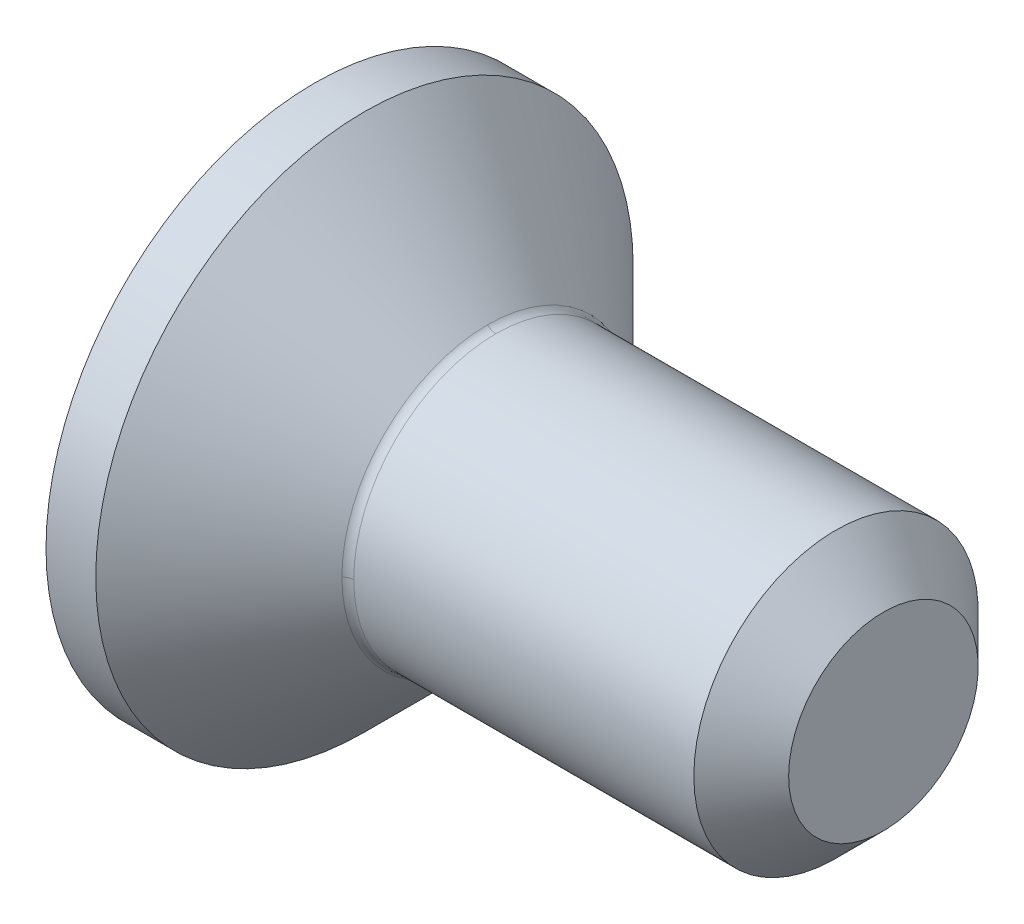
ISO-10303-21;
HEADER;
FILE_DESCRIPTION(('STEP AP214'),'2;1');
FILE_NAME('part.step','',(''),(''),'','','');
FILE_SCHEMA(('AUTOMOTIVE_DESIGN { 1 0 10303 214 1 1 1 1 }'));
ENDSEC;
DATA;
#1=APPLICATION_CONTEXT('core data for automotive mechanical design processes');
#2=APPLICATION_PROTOCOL_DEFINITION('international standard','automotive_design',2000,#1);
#3=PRODUCT_CONTEXT('',#1,'mechanical');
#4=PRODUCT('Part','Part','',(#3));
#5=PRODUCT_RELATED_PRODUCT_CATEGORY('part','',(#4));
#6=PRODUCT_DEFINITION_FORMATION('','',#4);
#7=PRODUCT_DEFINITION_CONTEXT('part definition',#1,'design');
#8=PRODUCT_DEFINITION('design','',#6,#7);
#9=PRODUCT_DEFINITION_SHAPE('','',#8);
#10=(LENGTH_UNIT() NAMED_UNIT(*) SI_UNIT(.MILLI.,.METRE.));
#11=(NAMED_UNIT(*) PLANE_ANGLE_UNIT() SI_UNIT($,.RADIAN.));
#12=(NAMED_UNIT(*) SI_UNIT($,.STERADIAN.) SOLID_ANGLE_UNIT());
#13=UNCERTAINTY_MEASURE_WITH_UNIT(LENGTH_MEASURE(1.E-05),#10,'distance_accuracy_value','');
#14=(GEOMETRIC_REPRESENTATION_CONTEXT(3) GLOBAL_UNCERTAINTY_ASSIGNED_CONTEXT((#13)) GLOBAL_UNIT_ASSIGNED_CONTEXT((#10,
#11,#12)) REPRESENTATION_CONTEXT('',''));
#15=CARTESIAN_POINT('',(0.,0.,0.));
#16=DIRECTION('',(0.,0.,1.));
#17=DIRECTION('',(1.,0.,0.));
#18=AXIS2_PLACEMENT_3D('',#15,#16,#17);
#19=CARTESIAN_POINT('',(12.,0.,0.));
#20=DIRECTION('',(1.,0.,0.));
#21=DIRECTION('',(0.,1.,0.));
#22=AXIS2_PLACEMENT_3D('',#19,#20,#21);
#23=PLANE('',#22);
#24=CARTESIAN_POINT('',(12.,0.,0.));
#25=DIRECTION('',(1.,0.,0.));
#26=DIRECTION('',(0.,0.,1.));
#27=AXIS2_PLACEMENT_3D('',#24,#25,#26);
#28=CIRCLE('',#27,2.);
#29=CARTESIAN_POINT('',(12.,0.,2.));
#30=VERTEX_POINT('',#29);
#31=EDGE_CURVE('E10',#30,#30,#28,.T.);
#32=ORIENTED_EDGE('',*,*,#31,.T.);
#33=EDGE_LOOP('',(#32));
#34=FACE_BOUND('',#33,.T.);
#35=ADVANCED_FACE('F16',(#34),#23,.T.);
#36=CARTESIAN_POINT('',(11.5,0.,0.));
#37=DIRECTION('',(-1.,0.,0.));
#38=DIRECTION('',(0.,0.,-1.));
#39=AXIS2_PLACEMENT_3D('',#36,#37,#38);
#40=CONICAL_SURFACE('',#39,2.5,0.785398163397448);
#41=ORIENTED_EDGE('',*,*,#31,.F.);
#42=EDGE_LOOP('',(#41));
#43=FACE_BOUND('',#42,.T.);
#44=CARTESIAN_POINT('',(11.,0.,0.));
#45=DIRECTION('',(1.,0.,0.));
#46=DIRECTION('',(0.,0.,1.));
#47=AXIS2_PLACEMENT_3D('',#44,#45,#46);
#48=CIRCLE('',#47,3.);
#49=CARTESIAN_POINT('',(11.,0.,3.));
#50=VERTEX_POINT('',#49);
#51=EDGE_CURVE('E20',#50,#50,#48,.T.);
#52=ORIENTED_EDGE('',*,*,#51,.T.);
#53=EDGE_LOOP('',(#52));
#54=FACE_BOUND('',#53,.T.);
#55=ADVANCED_FACE('F370',(#43,#54),#40,.T.);
#56=CARTESIAN_POINT('',(0.,0.,0.));
#57=DIRECTION('',(1.,0.,0.));
#58=DIRECTION('',(0.,0.,1.));
#59=AXIS2_PLACEMENT_3D('',#56,#57,#58);
#60=CYLINDRICAL_SURFACE('',#59,3.);
#61=CARTESIAN_POINT('',(3.82355339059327,0.,0.));
#62=DIRECTION('',(-1.,0.,0.));
#63=DIRECTION('',(0.,1.,0.));
#64=AXIS2_PLACEMENT_3D('',#61,#62,#63);
#65=CIRCLE('',#64,3.);
#66=CARTESIAN_POINT('',(3.82355339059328,0.,3.));
#67=VERTEX_POINT('',#66);
#68=CARTESIAN_POINT('',(3.82355339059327,3.,0.));
#69=VERTEX_POINT('',#68);
#70=EDGE_CURVE('E221',#67,#69,#65,.T.);
#71=ORIENTED_EDGE('',*,*,#70,.F.);
#72=CARTESIAN_POINT('',(3.82355339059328,0.,0.));
#73=DIRECTION('',(-1.,0.,0.));
#74=DIRECTION('',(0.,0.,1.));
#75=AXIS2_PLACEMENT_3D('',#72,#73,#74);
#76=CIRCLE('',#75,3.);
#77=EDGE_CURVE('E55',#69,#67,#76,.T.);
#78=ORIENTED_EDGE('',*,*,#77,.F.);
#79=EDGE_LOOP('',(#71,#78));
#80=FACE_BOUND('',#79,.T.);
#81=ORIENTED_EDGE('',*,*,#51,.F.);
#82=EDGE_LOOP('',(#81));
#83=FACE_BOUND('',#82,.T.);
#84=ADVANCED_FACE('F375',(#80,#83),#60,.T.);
#85=CARTESIAN_POINT('',(3.82355339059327,0.,0.));
#86=DIRECTION('',(1.,0.,0.));
#87=DIRECTION('',(0.,0.165896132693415,0.986143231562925));
#88=AXIS2_PLACEMENT_3D('',#85,#86,#87);
#89=TOROIDAL_SURFACE('',#88,3.25,0.25);
#90=ORIENTED_EDGE('',*,*,#77,.T.);
#91=CARTESIAN_POINT('',(3.82355339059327,0.,3.25));
#92=DIRECTION('',(0.,1.,0.));
#93=DIRECTION('',(0.,0.,-1.));
#94=AXIS2_PLACEMENT_3D('',#91,#92,#93);
#95=CIRCLE('',#94,0.25);
#96=CARTESIAN_POINT('',(3.64677669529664,0.,3.07322330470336));
#97=VERTEX_POINT('',#96);
#98=EDGE_CURVE('E65',#67,#97,#95,.T.);
#99=ORIENTED_EDGE('',*,*,#98,.T.);
#100=CARTESIAN_POINT('',(3.64677669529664,0.,0.));
#101=DIRECTION('',(-1.,0.,0.));
#102=DIRECTION('',(0.,0.,1.));
#103=AXIS2_PLACEMENT_3D('',#100,#101,#102);
#104=CIRCLE('',#103,3.07322330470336);
#105=CARTESIAN_POINT('',(3.64677669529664,3.07322330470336,0.));
#106=VERTEX_POINT('',#105);
#107=EDGE_CURVE('E229',#106,#97,#104,.T.);
#108=ORIENTED_EDGE('',*,*,#107,.F.);
#109=CARTESIAN_POINT('',(3.82355339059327,3.25,0.));
#110=DIRECTION('',(0.,0.,-1.));
#111=DIRECTION('',(0.,-1.,0.));
#112=AXIS2_PLACEMENT_3D('',#109,#110,#111);
#113=CIRCLE('',#112,0.25);
#114=EDGE_CURVE('E219',#69,#106,#113,.T.);
#115=ORIENTED_EDGE('',*,*,#114,.F.);
#116=EDGE_LOOP('',(#90,#99,#108,#115));
#117=FACE_BOUND('',#116,.T.);
#118=ADVANCED_FACE('F382',(#117),#89,.F.);
#119=CARTESIAN_POINT('',(3.82355339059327,0.,0.));
#120=DIRECTION('',(1.,0.,0.));
#121=DIRECTION('',(0.,0.986143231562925,-0.165896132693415));
#122=AXIS2_PLACEMENT_3D('',#119,#120,#121);
#123=TOROIDAL_SURFACE('',#122,3.25,0.25);
#124=ORIENTED_EDGE('',*,*,#70,.T.);
#125=ORIENTED_EDGE('',*,*,#114,.T.);
#126=CARTESIAN_POINT('',(3.64677669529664,0.,0.));
#127=DIRECTION('',(-1.,0.,0.));
#128=DIRECTION('',(0.,1.,0.));
#129=AXIS2_PLACEMENT_3D('',#126,#127,#128);
#130=CIRCLE('',#129,3.07322330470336);
#131=EDGE_CURVE('E247',#97,#106,#130,.T.);
#132=ORIENTED_EDGE('',*,*,#131,.F.);
#133=ORIENTED_EDGE('',*,*,#98,.F.);
#134=EDGE_LOOP('',(#124,#125,#132,#133));
#135=FACE_BOUND('',#134,.T.);
#136=ADVANCED_FACE('F364',(#135),#123,.F.);
#137=CARTESIAN_POINT('',(2.34838834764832,0.,0.));
#138=DIRECTION('',(-1.,0.,0.));
#139=DIRECTION('',(0.,-1.,0.));
#140=AXIS2_PLACEMENT_3D('',#137,#138,#139);
#141=CONICAL_SURFACE('',#140,4.37161165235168,0.785398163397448);
#142=ORIENTED_EDGE('',*,*,#107,.T.);
#143=ORIENTED_EDGE('',*,*,#131,.T.);
#144=EDGE_LOOP('',(#142,#143));
#145=FACE_BOUND('',#144,.T.);
#146=CARTESIAN_POINT('',(1.05,0.,0.));
#147=DIRECTION('',(1.,0.,0.));
#148=DIRECTION('',(0.,1.,0.));
#149=AXIS2_PLACEMENT_3D('',#146,#147,#148);
#150=CIRCLE('',#149,5.67);
#151=CARTESIAN_POINT('',(1.05,5.67,0.));
#152=VERTEX_POINT('',#151);
#153=EDGE_CURVE('E223',#152,#152,#150,.T.);
#154=ORIENTED_EDGE('',*,*,#153,.T.);
#155=EDGE_LOOP('',(#154));
#156=FACE_BOUND('',#155,.T.);
#157=ADVANCED_FACE('F355',(#145,#156),#141,.T.);
#158=CARTESIAN_POINT('',(0.,0.,0.));
#159=DIRECTION('',(1.,0.,0.));
#160=DIRECTION('',(0.,1.,0.));
#161=AXIS2_PLACEMENT_3D('',#158,#159,#160);
#162=CYLINDRICAL_SURFACE('',#161,5.67);
#163=ORIENTED_EDGE('',*,*,#153,.F.);
#164=EDGE_LOOP('',(#163));
#165=FACE_BOUND('',#164,.T.);
#166=CARTESIAN_POINT('',(0.,0.,0.));
#167=DIRECTION('',(1.,0.,0.));
#168=DIRECTION('',(0.,1.,0.));
#169=AXIS2_PLACEMENT_3D('',#166,#167,#168);
#170=CIRCLE('',#169,5.67);
#171=CARTESIAN_POINT('',(0.,5.67,0.));
#172=VERTEX_POINT('',#171);
#173=EDGE_CURVE('E241',#172,#172,#170,.T.);
#174=ORIENTED_EDGE('',*,*,#173,.T.);
#175=EDGE_LOOP('',(#174));
#176=FACE_BOUND('',#175,.T.);
#177=ADVANCED_FACE('F353',(#165,#176),#162,.T.);
#178=CARTESIAN_POINT('',(0.,-1.15470053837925,2.));
#179=DIRECTION('',(0.,-0.866025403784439,0.5));
#180=DIRECTION('',(-1.,0.,0.));
#181=AXIS2_PLACEMENT_3D('',#178,#179,#180);
#182=PLANE('',#181);
#183=CARTESIAN_POINT('',(2.2000000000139,-1.15470053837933,2.00000000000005));
#184=CARTESIAN_POINT('',(2.20628477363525,-1.16558615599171,1.98114555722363));
#185=CARTESIAN_POINT('',(2.21860359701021,-1.18738419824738,1.94339024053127));
#186=CARTESIAN_POINT('',(2.23630182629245,-1.2201886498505,1.88657126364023));
#187=CARTESIAN_POINT('',(2.25315590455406,-1.25305795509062,1.82963995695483));
#188=CARTESIAN_POINT('',(2.2691263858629,-1.28599420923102,1.77259269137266));
#189=CARTESIAN_POINT('',(2.28416770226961,-1.31898707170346,1.71544737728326));
#190=CARTESIAN_POINT('',(2.29824243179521,-1.35204305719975,1.6581927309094));
#191=CARTESIAN_POINT('',(2.31130665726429,-1.38515220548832,1.60084600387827));
#192=CARTESIAN_POINT('',(2.3233262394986,-1.4183272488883,1.54338514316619));
#193=CARTESIAN_POINT('',(2.33425863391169,-1.4515566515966,1.48583012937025));
#194=CARTESIAN_POINT('',(2.34406584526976,-1.48483418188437,1.42819175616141));
#195=CARTESIAN_POINT('',(2.3527073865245,-1.51813065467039,1.37052057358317));
#196=CARTESIAN_POINT('',(2.36015564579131,-1.55144683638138,1.31281525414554));
#197=CARTESIAN_POINT('',(2.36638067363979,-1.58475539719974,1.25512313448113));
#198=CARTESIAN_POINT('',(2.37136479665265,-1.61806401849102,1.19743091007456));
#199=CARTESIAN_POINT('',(2.37508959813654,-1.65134625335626,1.13978438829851));
#200=CARTESIAN_POINT('',(2.37754480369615,-1.6845918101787,1.08220139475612));
#201=CARTESIAN_POINT('',(2.3785027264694,-1.71149059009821,1.03561134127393));
#202=CARTESIAN_POINT('',(2.37868334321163,-1.73344525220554,0.99758475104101));
#203=CARTESIAN_POINT('',(2.37845255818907,-1.75513107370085,0.960023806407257));
#204=CARTESIAN_POINT('',(2.37735405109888,-1.78261449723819,0.91242112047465));
#205=CARTESIAN_POINT('',(2.3749167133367,-1.81435304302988,0.857448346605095));
#206=CARTESIAN_POINT('',(2.3708442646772,-1.85048337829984,0.79486877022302));
#207=CARTESIAN_POINT('',(2.36378727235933,-1.8956599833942,0.716620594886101));
#208=CARTESIAN_POINT('',(2.35210279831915,-1.95019541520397,0.622162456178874));
#209=CARTESIAN_POINT('',(2.33699422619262,-2.00457343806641,0.527976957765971));
#210=CARTESIAN_POINT('',(2.32219730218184,-2.04916844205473,0.450736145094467));
#211=CARTESIAN_POINT('',(2.30982283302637,-2.08270975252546,0.392640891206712));
#212=CARTESIAN_POINT('',(2.29952226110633,-2.10873393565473,0.347565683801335));
#213=CARTESIAN_POINT('',(2.28958254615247,-2.13246755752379,0.306457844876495));
#214=CARTESIAN_POINT('',(2.27968049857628,-2.15498908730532,0.267449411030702));
#215=CARTESIAN_POINT('',(2.26937704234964,-2.17739092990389,0.228648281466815));
#216=CARTESIAN_POINT('',(2.25870093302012,-2.19965166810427,0.190091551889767));
#217=CARTESIAN_POINT('',(2.24765859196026,-2.22179638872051,0.15173577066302));
#218=CARTESIAN_POINT('',(2.23626571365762,-2.24382809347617,0.113575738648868));
#219=CARTESIAN_POINT('',(2.22452582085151,-2.26577092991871,0.0755696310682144));
#220=CARTESIAN_POINT('',(2.21245352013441,-2.28762604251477,0.037715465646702));
#221=CARTESIAN_POINT('',(2.20418556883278,-2.302151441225,0.0125567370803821));
#222=CARTESIAN_POINT('',(2.2000000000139,-2.3094010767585,0.));
#223=(BOUNDED_CURVE() B_SPLINE_CURVE(3,(#183,#184,#185,#186,#187,#188,#189,#190,#191,#192,#193,
#194,#195,#196,#197,#198,#199,#200,#201,#202,#203,#204,#205,#206,#207,#208,#209,#210,#211,#212,
#213,#214,#215,#216,#217,#218,#219,#220,#221,#222),.UNSPECIFIED.,.F.,
.F.) B_SPLINE_CURVE_WITH_KNOTS((4,1,1,1,1,1,1,1,1,1,1,1,1,1,1,1,1,1,1,1,1,1,1,1,1,1,1,1,1,1,1,1,
1,1,1,1,1,4),(-1.,-0.970940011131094,-0.94193566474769,-0.912980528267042,-0.884091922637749,
-0.855234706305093,-0.826435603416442,-0.797668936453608,-0.768942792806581,-0.7402250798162,
-0.711553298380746,-0.682914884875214,-0.654336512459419,-0.625777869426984,-0.597298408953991,
-0.56883900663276,-0.540446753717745,-0.512139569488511,-0.49998427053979,-0.484259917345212,
-0.45664455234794,-0.429649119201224,-0.403001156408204,-0.364073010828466,-0.313740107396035,
-0.262696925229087,-0.223581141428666,-0.198057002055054,-0.175420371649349,-0.155703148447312,
-0.136019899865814,-0.116430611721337,-0.0969018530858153,-0.0774601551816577,
-0.0580433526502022,-0.0386758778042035,-0.0193286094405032,0.),
.UNSPECIFIED.) CURVE() GEOMETRIC_REPRESENTATION_ITEM() RATIONAL_B_SPLINE_CURVE((1.,1.,1.,1.,1.,
1.,1.,1.,1.,1.,1.,1.,1.,1.,1.,1.,1.,1.,1.,1.,1.,1.,1.,1.,1.,1.,1.,1.,1.,1.,1.,1.,1.,1.,1.,1.,1.,
1.,1.,1.)) REPRESENTATION_ITEM(''));
#224=CARTESIAN_POINT('',(2.20000000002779,-1.15470053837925,2.));
#225=VERTEX_POINT('',#224);
#226=CARTESIAN_POINT('',(2.20000000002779,-2.3094010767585,0.));
#227=VERTEX_POINT('',#226);
#228=EDGE_CURVE('E187',#225,#227,#223,.T.);
#229=ORIENTED_EDGE('',*,*,#228,.T.);
#230=DIRECTION('',(1.,0.,0.));
#231=VECTOR('',#230,1.);
#232=CARTESIAN_POINT('',(0.,-2.3094010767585,0.));
#233=LINE('',#232,#231);
#234=CARTESIAN_POINT('',(0.,-2.3094010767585,0.));
#235=VERTEX_POINT('',#234);
#236=EDGE_CURVE('E116',#235,#227,#233,.T.);
#237=ORIENTED_EDGE('',*,*,#236,.F.);
#238=DIRECTION('',(0.,-0.5,-0.866025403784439));
#239=VECTOR('',#238,1.);
#240=CARTESIAN_POINT('',(0.,-1.15470053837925,2.));
#241=LINE('',#240,#239);
#242=CARTESIAN_POINT('',(0.,-1.15470053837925,2.));
#243=VERTEX_POINT('',#242);
#244=EDGE_CURVE('E206',#243,#235,#241,.T.);
#245=ORIENTED_EDGE('',*,*,#244,.F.);
#246=DIRECTION('',(1.,0.,0.));
#247=VECTOR('',#246,1.);
#248=CARTESIAN_POINT('',(0.,-1.15470053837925,2.));
#249=LINE('',#248,#247);
#250=EDGE_CURVE('E197',#243,#225,#249,.T.);
#251=ORIENTED_EDGE('',*,*,#250,.T.);
#252=EDGE_LOOP('',(#229,#237,#245,#251));
#253=FACE_BOUND('',#252,.T.);
#254=ADVANCED_FACE('F336',(#253),#182,.F.);
#255=CARTESIAN_POINT('',(0.,-2.3094010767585,0.));
#256=DIRECTION('',(0.,-0.866025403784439,-0.5));
#257=DIRECTION('',(0.,0.5,-0.866025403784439));
#258=AXIS2_PLACEMENT_3D('',#255,#256,#257);
#259=PLANE('',#258);
#260=CARTESIAN_POINT('',(2.2000000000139,-2.30940107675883,-1.94066984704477E-13));
#261=CARTESIAN_POINT('',(2.20628477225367,-2.29851546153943,-0.0188544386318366));
#262=CARTESIAN_POINT('',(2.2186035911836,-2.27671742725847,-0.0566097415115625));
#263=CARTESIAN_POINT('',(2.23630181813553,-2.24391298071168,-0.113428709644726));
#264=CARTESIAN_POINT('',(2.25315589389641,-2.21104368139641,-0.170360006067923));
#265=CARTESIAN_POINT('',(2.26912637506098,-2.17810742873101,-0.227407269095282));
#266=CARTESIAN_POINT('',(2.28416768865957,-2.14511457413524,-0.28455256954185));
#267=CARTESIAN_POINT('',(2.29824241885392,-2.11205858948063,-0.341807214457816));
#268=CARTESIAN_POINT('',(2.31130664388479,-2.07894944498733,-0.399153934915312));
#269=CARTESIAN_POINT('',(2.32332622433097,-2.04577440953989,-0.456614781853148));
#270=CARTESIAN_POINT('',(2.33425861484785,-2.0125450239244,-0.514169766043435));
#271=CARTESIAN_POINT('',(2.34406582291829,-1.97926751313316,-0.571808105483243));
#272=CARTESIAN_POINT('',(2.35270736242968,-1.94597105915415,-0.629479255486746));
#273=CARTESIAN_POINT('',(2.36015562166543,-1.91265489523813,-0.687184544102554));
#274=CARTESIAN_POINT('',(2.36638065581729,-1.87934632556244,-0.744876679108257));
#275=CARTESIAN_POINT('',(2.37136478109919,-1.84603771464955,-0.802568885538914));
#276=CARTESIAN_POINT('',(2.37508958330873,-1.81275551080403,-0.860215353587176));
#277=CARTESIAN_POINT('',(2.37754479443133,-1.77950997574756,-0.91779830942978));
#278=CARTESIAN_POINT('',(2.37850272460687,-1.75261114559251,-0.964388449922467));
#279=CARTESIAN_POINT('',(2.37868334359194,-1.73065642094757,-1.00241514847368));
#280=CARTESIAN_POINT('',(2.37845255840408,-1.70897053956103,-1.03997619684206));
#281=CARTESIAN_POINT('',(2.37735405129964,-1.68148711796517,-1.0875788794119));
#282=CARTESIAN_POINT('',(2.37491671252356,-1.64974856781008,-1.14255166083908));
#283=CARTESIAN_POINT('',(2.37084426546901,-1.61361824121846,-1.20513122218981));
#284=CARTESIAN_POINT('',(2.36378727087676,-1.56844162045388,-1.2833794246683));
#285=CARTESIAN_POINT('',(2.35210279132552,-1.51390617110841,-1.37783759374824));
#286=CARTESIAN_POINT('',(2.33699421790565,-1.45952815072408,-1.47202308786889));
#287=CARTESIAN_POINT('',(2.32219729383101,-1.41493314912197,-1.54926389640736));
#288=CARTESIAN_POINT('',(2.30982282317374,-1.38139183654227,-1.60735915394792));
#289=CARTESIAN_POINT('',(2.29952224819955,-1.35536764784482,-1.65243437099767));
#290=CARTESIAN_POINT('',(2.28958253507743,-1.33163403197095,-1.69354219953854));
#291=CARTESIAN_POINT('',(2.27968049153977,-1.30911251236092,-1.73255061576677));
#292=CARTESIAN_POINT('',(2.26937703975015,-1.28671067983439,-1.77135172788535));
#293=CARTESIAN_POINT('',(2.25870093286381,-1.26444994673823,-1.80990844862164));
#294=CARTESIAN_POINT('',(2.24765859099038,-1.24230522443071,-1.84826423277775));
#295=CARTESIAN_POINT('',(2.2362657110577,-1.22027351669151,-1.88642426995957));
#296=CARTESIAN_POINT('',(2.22452581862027,-1.19833068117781,-1.92443037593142));
#297=CARTESIAN_POINT('',(2.21245351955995,-1.1764755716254,-1.96228453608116));
#298=CARTESIAN_POINT('',(2.20418556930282,-1.1619501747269,-1.98744326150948));
#299=CARTESIAN_POINT('',(2.2000000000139,-1.15470053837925,-2.));
#300=(BOUNDED_CURVE() B_SPLINE_CURVE(3,(#260,#261,#262,#263,#264,#265,#266,#267,#268,#269,#270,
#271,#272,#273,#274,#275,#276,#277,#278,#279,#280,#281,#282,#283,#284,#285,#286,#287,#288,#289,
#290,#291,#292,#293,#294,#295,#296,#297,#298,#299),.UNSPECIFIED.,.F.,
.F.) B_SPLINE_CURVE_WITH_KNOTS((4,1,1,1,1,1,1,1,1,1,1,1,1,1,1,1,1,1,1,1,1,1,1,1,1,1,1,1,1,1,1,1,
1,1,1,1,1,4),(-1.,-0.970940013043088,-0.94193567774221,-0.912980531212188,-0.884091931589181,
-0.855234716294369,-0.826435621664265,-0.797668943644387,-0.768942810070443,-0.740225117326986,
-0.711553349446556,-0.682914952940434,-0.654336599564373,-0.625777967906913,-0.597298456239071,
-0.568839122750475,-0.540446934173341,-0.512139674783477,-0.499984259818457,-0.48425993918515,
-0.45664450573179,-0.429649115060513,-0.403001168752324,-0.364072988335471,-0.313740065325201,
-0.262696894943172,-0.223581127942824,-0.198056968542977,-0.175420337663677,-0.155703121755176,
-0.136019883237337,-0.116430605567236,-0.0969018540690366,-0.0774601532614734,
-0.0580433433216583,-0.0386758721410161,-0.0193286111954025,0.),
.UNSPECIFIED.) CURVE() GEOMETRIC_REPRESENTATION_ITEM() RATIONAL_B_SPLINE_CURVE((1.,1.,1.,1.,1.,
1.,1.,1.,1.,1.,1.,1.,1.,1.,1.,1.,1.,1.,1.,1.,1.,1.,1.,1.,1.,1.,1.,1.,1.,1.,1.,1.,1.,1.,1.,1.,1.,
1.,1.,1.)) REPRESENTATION_ITEM(''));
#301=CARTESIAN_POINT('',(2.20000000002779,-1.15470053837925,-2.));
#302=VERTEX_POINT('',#301);
#303=EDGE_CURVE('E179',#227,#302,#300,.T.);
#304=ORIENTED_EDGE('',*,*,#303,.T.);
#305=DIRECTION('',(1.,0.,0.));
#306=VECTOR('',#305,1.);
#307=CARTESIAN_POINT('',(0.,-1.15470053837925,-2.));
#308=LINE('',#307,#306);
#309=CARTESIAN_POINT('',(0.,-1.15470053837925,-2.));
#310=VERTEX_POINT('',#309);
#311=EDGE_CURVE('E105',#310,#302,#308,.T.);
#312=ORIENTED_EDGE('',*,*,#311,.F.);
#313=DIRECTION('',(0.,0.5,-0.866025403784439));
#314=VECTOR('',#313,1.);
#315=CARTESIAN_POINT('',(0.,-2.3094010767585,0.));
#316=LINE('',#315,#314);
#317=EDGE_CURVE('E198',#235,#310,#316,.T.);
#318=ORIENTED_EDGE('',*,*,#317,.F.);
#319=ORIENTED_EDGE('',*,*,#236,.T.);
#320=EDGE_LOOP('',(#304,#312,#318,#319));
#321=FACE_BOUND('',#320,.T.);
#322=ADVANCED_FACE('F341',(#321),#259,.F.);
#323=CARTESIAN_POINT('',(0.,-1.15470053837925,-2.));
#324=DIRECTION('',(0.,0.,-1.));
#325=DIRECTION('',(0.,-1.,0.));
#326=AXIS2_PLACEMENT_3D('',#323,#324,#325);
#327=PLANE('',#326);
#328=CARTESIAN_POINT('',(2.2000000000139,-1.15470053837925,-2.));
#329=CARTESIAN_POINT('',(2.20628479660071,-1.13292930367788,-2.));
#330=CARTESIAN_POINT('',(2.2127716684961,-1.10997233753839,-2.));
#331=CARTESIAN_POINT('',(2.2248221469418,-1.06628046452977,-2.));
#332=CARTESIAN_POINT('',(2.23659597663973,-1.02257701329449,-2.));
#333=CARTESIAN_POINT('',(2.25315590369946,-0.957985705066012,-2.));
#334=CARTESIAN_POINT('',(2.26530302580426,-0.907883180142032,-2.));
#335=CARTESIAN_POINT('',(2.27555507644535,-0.863910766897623,-2.));
#336=CARTESIAN_POINT('',(2.28548699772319,-0.819930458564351,-2.));
#337=CARTESIAN_POINT('',(2.29824243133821,-0.760015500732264,-2.));
#338=CARTESIAN_POINT('',(2.31130665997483,-0.693797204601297,-2.));
#339=CARTESIAN_POINT('',(2.32049599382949,-0.643070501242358,-2.));
#340=CARTESIAN_POINT('',(2.32804168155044,-0.598781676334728,-2.));
#341=CARTESIAN_POINT('',(2.33521826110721,-0.55447591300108,-2.));
#342=CARTESIAN_POINT('',(2.34406585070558,-0.494433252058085,-2.));
#343=CARTESIAN_POINT('',(2.35130568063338,-0.438641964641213,-2.));
#344=CARTESIAN_POINT('',(2.35646605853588,-0.394215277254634,-2.));
#345=CARTESIAN_POINT('',(2.36122058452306,-0.349811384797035,-2.));
#346=CARTESIAN_POINT('',(2.36638067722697,-0.294590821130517,-2.));
#347=CARTESIAN_POINT('',(2.37136479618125,-0.227973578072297,-2.));
#348=CARTESIAN_POINT('',(2.37491527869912,-0.164524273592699,-2.));
#349=CARTESIAN_POINT('',(2.37661355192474,-0.120137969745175,-2.));
#350=CARTESIAN_POINT('',(2.37788424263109,-0.075854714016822,-2.));
#351=CARTESIAN_POINT('',(2.37850272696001,-0.0411204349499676,-2.));
#352=CARTESIAN_POINT('',(2.37868334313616,0.00278888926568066,-2.));
#353=CARTESIAN_POINT('',(2.37845255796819,0.0461605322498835,-2.));
#354=CARTESIAN_POINT('',(2.37735405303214,0.101127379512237,-2.));
#355=CARTESIAN_POINT('',(2.37537480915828,0.152673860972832,-2.));
#356=CARTESIAN_POINT('',(2.37322870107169,0.194556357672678,-2.));
#357=CARTESIAN_POINT('',(2.3701516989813,0.245732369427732,-2.));
#358=CARTESIAN_POINT('',(2.36523440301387,0.30868874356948,-2.));
#359=CARTESIAN_POINT('',(2.35833351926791,0.378129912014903,-2.));
#360=CARTESIAN_POINT('',(2.34924611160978,0.456851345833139,-2.));
#361=CARTESIAN_POINT('',(2.33704756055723,0.544661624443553,-2.));
#362=CARTESIAN_POINT('',(2.32552547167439,0.614174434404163,-2.));
#363=CARTESIAN_POINT('',(2.31672154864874,0.663919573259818,-2.));
#364=CARTESIAN_POINT('',(2.30982283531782,0.701317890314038,-2.));
#365=CARTESIAN_POINT('',(2.29952226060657,0.753366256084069,-2.));
#366=CARTESIAN_POINT('',(2.28958254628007,0.800833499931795,-2.));
#367=CARTESIAN_POINT('',(2.27968049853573,0.845876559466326,-2.));
#368=CARTESIAN_POINT('',(2.26937704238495,0.890680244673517,-2.));
#369=CARTESIAN_POINT('',(2.25870093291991,0.935201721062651,-2.));
#370=CARTESIAN_POINT('',(2.25081226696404,0.966842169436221,-2.));
#371=CARTESIAN_POINT('',(2.2433180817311,0.99627863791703,-2.));
#372=CARTESIAN_POINT('',(2.23571205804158,1.02562422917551,-2.));
#373=CARTESIAN_POINT('',(2.22452582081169,1.06744024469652,-2.));
#374=CARTESIAN_POINT('',(2.21245352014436,1.11115046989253,-2.));
#375=CARTESIAN_POINT('',(2.20418556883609,1.14020126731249,-2.));
#376=CARTESIAN_POINT('',(2.2000000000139,1.15470053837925,-2.));
#377=(BOUNDED_CURVE() B_SPLINE_CURVE(3,(#328,#329,#330,#331,#332,#333,#334,#335,#336,#337,#338,
#339,#340,#341,#342,#343,#344,#345,#346,#347,#348,#349,#350,#351,#352,#353,#354,#355,#356,#357,
#358,#359,#360,#361,#362,#363,#364,#365,#366,#367,#368,#369,#370,#371,#372,#373,#374,#375,#376),
.UNSPECIFIED.,.F.,.F.) B_SPLINE_CURVE_WITH_KNOTS((4,1,1,1,1,1,1,1,1,1,1,1,1,1,1,1,1,1,1,1,1,1,1,
1,1,1,1,1,1,1,1,1,1,1,1,1,1,1,1,1,1,1,1,1,1,1,4),(-1.,-0.970940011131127,-0.969424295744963,
-0.941935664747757,-0.91298052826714,-0.884091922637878,-0.875991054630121,-0.85523470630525,
-0.826435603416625,-0.797668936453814,-0.768942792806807,-0.760524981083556,-0.740225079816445,
-0.711553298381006,-0.682914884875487,-0.668268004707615,-0.654336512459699,-0.62577786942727,
-0.597298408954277,-0.568839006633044,-0.54444018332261,-0.540446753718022,-0.512139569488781,
-0.499984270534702,-0.48425991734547,-0.456644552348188,-0.429649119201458,-0.418273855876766,
-0.403001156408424,-0.364073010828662,-0.337510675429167,-0.313740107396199,-0.262696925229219,
-0.224076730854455,-0.223581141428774,-0.198057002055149,-0.175420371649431,-0.155703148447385,
-0.136019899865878,-0.11643061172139,-0.0969018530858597,-0.0774601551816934,
-0.0747186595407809,-0.0580433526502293,-0.0386758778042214,-0.0193286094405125,0.),
.UNSPECIFIED.) CURVE() GEOMETRIC_REPRESENTATION_ITEM() RATIONAL_B_SPLINE_CURVE((1.,1.,1.,1.,1.,
1.,1.,1.,1.,1.,1.,1.,1.,1.,1.,1.,1.,1.,1.,1.,1.,1.,1.,1.,1.,1.,1.,1.,1.,1.,1.,1.,1.,1.,1.,1.,1.,
1.,1.,1.,1.,1.,1.,1.,1.,1.,1.,1.,1.)) REPRESENTATION_ITEM(''));
#378=CARTESIAN_POINT('',(2.20000000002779,1.15470053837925,-2.));
#379=VERTEX_POINT('',#378);
#380=EDGE_CURVE('E160',#302,#379,#377,.T.);
#381=ORIENTED_EDGE('',*,*,#380,.T.);
#382=DIRECTION('',(1.,0.,0.));
#383=VECTOR('',#382,1.);
#384=CARTESIAN_POINT('',(0.,1.15470053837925,-2.));
#385=LINE('',#384,#383);
#386=CARTESIAN_POINT('',(0.,1.15470053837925,-2.));
#387=VERTEX_POINT('',#386);
#388=EDGE_CURVE('E150',#387,#379,#385,.T.);
#389=ORIENTED_EDGE('',*,*,#388,.F.);
#390=DIRECTION('',(0.,1.,0.));
#391=VECTOR('',#390,1.);
#392=CARTESIAN_POINT('',(0.,-1.15470053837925,-2.));
#393=LINE('',#392,#391);
#394=EDGE_CURVE('E205',#310,#387,#393,.T.);
#395=ORIENTED_EDGE('',*,*,#394,.F.);
#396=ORIENTED_EDGE('',*,*,#311,.T.);
#397=EDGE_LOOP('',(#381,#389,#395,#396));
#398=FACE_BOUND('',#397,.T.);
#399=ADVANCED_FACE('F342',(#398),#327,.F.);
#400=CARTESIAN_POINT('',(0.,1.15470053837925,-2.));
#401=DIRECTION('',(0.,0.866025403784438,-0.5));
#402=DIRECTION('',(-1.,0.,0.));
#403=AXIS2_PLACEMENT_3D('',#400,#401,#402);
#404=PLANE('',#403);
#405=CARTESIAN_POINT('',(2.2000000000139,1.1547005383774,-1.99999999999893));
#406=CARTESIAN_POINT('',(2.20628477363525,1.16558615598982,-1.98114555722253));
#407=CARTESIAN_POINT('',(2.21860359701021,1.18738419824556,-1.94339024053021));
#408=CARTESIAN_POINT('',(2.23630182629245,1.22018864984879,-1.88657126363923));
#409=CARTESIAN_POINT('',(2.25315590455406,1.25305795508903,-1.82963995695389));
#410=CARTESIAN_POINT('',(2.26912638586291,1.28599420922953,-1.77259269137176));
#411=CARTESIAN_POINT('',(2.28416770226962,1.31898707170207,-1.71544737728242));
#412=CARTESIAN_POINT('',(2.29824243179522,1.35204305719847,-1.65819273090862));
#413=CARTESIAN_POINT('',(2.3113066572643,1.38515220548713,-1.60084600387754));
#414=CARTESIAN_POINT('',(2.32332623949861,1.41832724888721,-1.5433851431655));
#415=CARTESIAN_POINT('',(2.33425863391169,1.4515566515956,-1.4858301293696));
#416=CARTESIAN_POINT('',(2.34406584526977,1.48483418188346,-1.42819175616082));
#417=CARTESIAN_POINT('',(2.35270738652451,1.51813065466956,-1.37052057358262));
#418=CARTESIAN_POINT('',(2.36015564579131,1.55144683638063,-1.31281525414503));
#419=CARTESIAN_POINT('',(2.3663806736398,1.58475539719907,-1.25512313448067));
#420=CARTESIAN_POINT('',(2.37136479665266,1.61806401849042,-1.19743091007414));
#421=CARTESIAN_POINT('',(2.37508959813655,1.65134625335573,-1.13978438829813));
#422=CARTESIAN_POINT('',(2.37754480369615,1.68459181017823,-1.08220139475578));
#423=CARTESIAN_POINT('',(2.3785027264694,1.71149059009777,-1.03561134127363));
#424=CARTESIAN_POINT('',(2.37868334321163,1.73344525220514,-0.997584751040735));
#425=CARTESIAN_POINT('',(2.37845255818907,1.75513107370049,-0.960023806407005));
#426=CARTESIAN_POINT('',(2.37735405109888,1.78261449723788,-0.912421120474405));
#427=CARTESIAN_POINT('',(2.3749167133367,1.81435304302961,-0.857448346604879));
#428=CARTESIAN_POINT('',(2.37084426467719,1.85048337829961,-0.794868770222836));
#429=CARTESIAN_POINT('',(2.36378727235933,1.89565998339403,-0.716620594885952));
#430=CARTESIAN_POINT('',(2.35210279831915,1.95019541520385,-0.622162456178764));
#431=CARTESIAN_POINT('',(2.33699422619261,2.00457343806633,-0.527976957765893));
#432=CARTESIAN_POINT('',(2.32219730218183,2.04916844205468,-0.450736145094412));
#433=CARTESIAN_POINT('',(2.30982283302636,2.08270975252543,-0.392640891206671));
#434=CARTESIAN_POINT('',(2.29952226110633,2.10873393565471,-0.347565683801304));
#435=CARTESIAN_POINT('',(2.28958254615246,2.13246755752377,-0.306457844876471));
#436=CARTESIAN_POINT('',(2.27968049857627,2.15498908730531,-0.267449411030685));
#437=CARTESIAN_POINT('',(2.26937704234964,2.17739092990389,-0.228648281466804));
#438=CARTESIAN_POINT('',(2.25870093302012,2.19965166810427,-0.190091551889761));
#439=CARTESIAN_POINT('',(2.24765859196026,2.22179638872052,-0.151735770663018));
#440=CARTESIAN_POINT('',(2.23626571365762,2.24382809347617,-0.11357573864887));
#441=CARTESIAN_POINT('',(2.22452582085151,2.26577092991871,-0.0755696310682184));
#442=CARTESIAN_POINT('',(2.21245352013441,2.28762604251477,-0.0377154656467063));
#443=CARTESIAN_POINT('',(2.20418556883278,2.302151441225,-0.0125567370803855));
#444=CARTESIAN_POINT('',(2.2000000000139,2.3094010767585,0.));
#445=(BOUNDED_CURVE() B_SPLINE_CURVE(3,(#405,#406,#407,#408,#409,#410,#411,#412,#413,#414,#415,
#416,#417,#418,#419,#420,#421,#422,#423,#424,#425,#426,#427,#428,#429,#430,#431,#432,#433,#434,
#435,#436,#437,#438,#439,#440,#441,#442,#443,#444),.UNSPECIFIED.,.F.,
.F.) B_SPLINE_CURVE_WITH_KNOTS((4,1,1,1,1,1,1,1,1,1,1,1,1,1,1,1,1,1,1,1,1,1,1,1,1,1,1,1,1,1,1,1,
1,1,1,1,1,4),(-1.,-0.970940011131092,-0.941935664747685,-0.912980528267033,-0.884091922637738,
-0.855234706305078,-0.826435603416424,-0.797668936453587,-0.768942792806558,-0.740225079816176,
-0.711553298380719,-0.682914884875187,-0.654336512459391,-0.625777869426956,-0.597298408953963,
-0.568839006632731,-0.540446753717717,-0.512139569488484,-0.49998427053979,-0.484259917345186,
-0.456644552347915,-0.4296491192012,-0.403001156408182,-0.364073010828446,-0.313740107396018,
-0.262696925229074,-0.223581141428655,-0.198057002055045,-0.175420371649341,-0.155703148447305,
-0.136019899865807,-0.116430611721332,-0.0969018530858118,-0.0774601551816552,
-0.058043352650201,-0.0386758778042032,-0.0193286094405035,0.),
.UNSPECIFIED.) CURVE() GEOMETRIC_REPRESENTATION_ITEM() RATIONAL_B_SPLINE_CURVE((1.,1.,1.,1.,1.,
1.,1.,1.,1.,1.,1.,1.,1.,1.,1.,1.,1.,1.,1.,1.,1.,1.,1.,1.,1.,1.,1.,1.,1.,1.,1.,1.,1.,1.,1.,1.,1.,
1.,1.,1.)) REPRESENTATION_ITEM(''));
#446=CARTESIAN_POINT('',(2.20000000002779,2.3094010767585,0.));
#447=VERTEX_POINT('',#446);
#448=EDGE_CURVE('E154',#379,#447,#445,.T.);
#449=ORIENTED_EDGE('',*,*,#448,.T.);
#450=DIRECTION('',(1.,0.,0.));
#451=VECTOR('',#450,1.);
#452=CARTESIAN_POINT('',(0.,2.3094010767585,0.));
#453=LINE('',#452,#451);
#454=CARTESIAN_POINT('',(0.,2.3094010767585,0.));
#455=VERTEX_POINT('',#454);
#456=EDGE_CURVE('E138',#455,#447,#453,.T.);
#457=ORIENTED_EDGE('',*,*,#456,.F.);
#458=DIRECTION('',(0.,0.5,0.866025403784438));
#459=VECTOR('',#458,1.);
#460=CARTESIAN_POINT('',(0.,1.15470053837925,-2.));
#461=LINE('',#460,#459);
#462=EDGE_CURVE('E209',#387,#455,#461,.T.);
#463=ORIENTED_EDGE('',*,*,#462,.F.);
#464=ORIENTED_EDGE('',*,*,#388,.T.);
#465=EDGE_LOOP('',(#449,#457,#463,#464));
#466=FACE_BOUND('',#465,.T.);
#467=ADVANCED_FACE('F155',(#466),#404,.F.);
#468=CARTESIAN_POINT('',(0.,2.3094010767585,0.));
#469=DIRECTION('',(0.,0.866025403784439,0.5));
#470=DIRECTION('',(1.,0.,0.));
#471=AXIS2_PLACEMENT_3D('',#468,#469,#470);
#472=PLANE('',#471);
#473=CARTESIAN_POINT('',(2.2000000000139,2.30940107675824,-1.52766688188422E-13));
#474=CARTESIAN_POINT('',(2.20628477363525,2.29851545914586,0.0188544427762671));
#475=CARTESIAN_POINT('',(2.21860359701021,2.27671741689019,0.0566097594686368));
#476=CARTESIAN_POINT('',(2.23630182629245,2.24391296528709,0.113428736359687));
#477=CARTESIAN_POINT('',(2.25315590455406,2.21104366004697,0.170360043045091));
#478=CARTESIAN_POINT('',(2.26912638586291,2.17810740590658,0.227407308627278));
#479=CARTESIAN_POINT('',(2.28416770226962,2.14511454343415,0.284552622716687));
#480=CARTESIAN_POINT('',(2.29824243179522,2.11205855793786,0.341807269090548));
#481=CARTESIAN_POINT('',(2.31130665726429,2.07894940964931,0.399153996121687));
#482=CARTESIAN_POINT('',(2.3233262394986,2.04577436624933,0.456614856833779));
#483=CARTESIAN_POINT('',(2.33425863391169,2.01254496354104,0.51416987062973));
#484=CARTESIAN_POINT('',(2.34406584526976,1.97926743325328,0.571808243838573));
#485=CARTESIAN_POINT('',(2.3527073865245,1.94597096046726,0.629479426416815));
#486=CARTESIAN_POINT('',(2.36015564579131,1.91265477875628,0.687184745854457));
#487=CARTESIAN_POINT('',(2.3663806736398,1.87934621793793,0.744876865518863));
#488=CARTESIAN_POINT('',(2.37136479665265,1.84603759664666,0.802569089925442));
#489=CARTESIAN_POINT('',(2.37508959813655,1.81275536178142,0.860215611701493));
#490=CARTESIAN_POINT('',(2.37754480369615,1.77950980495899,0.917798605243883));
#491=CARTESIAN_POINT('',(2.3785027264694,1.75261102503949,0.964388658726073));
#492=CARTESIAN_POINT('',(2.37868334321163,1.73065636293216,1.00241524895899));
#493=CARTESIAN_POINT('',(2.37845255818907,1.70897054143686,1.03997619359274));
#494=CARTESIAN_POINT('',(2.37735405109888,1.68148711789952,1.08757887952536));
#495=CARTESIAN_POINT('',(2.3749167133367,1.64974857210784,1.14255165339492));
#496=CARTESIAN_POINT('',(2.37084426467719,1.61361823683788,1.20513122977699));
#497=CARTESIAN_POINT('',(2.36378727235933,1.56844163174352,1.28337940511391));
#498=CARTESIAN_POINT('',(2.35210279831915,1.51390619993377,1.37783754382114));
#499=CARTESIAN_POINT('',(2.33699422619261,1.45952817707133,1.47202304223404));
#500=CARTESIAN_POINT('',(2.32219730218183,1.41493317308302,1.54926385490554));
#501=CARTESIAN_POINT('',(2.30982283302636,1.38139186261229,1.60735910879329));
#502=CARTESIAN_POINT('',(2.29952226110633,1.35536767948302,1.65243431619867));
#503=CARTESIAN_POINT('',(2.28958254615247,1.33163405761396,1.69354215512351));
#504=CARTESIAN_POINT('',(2.27968049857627,1.30911252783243,1.7325505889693));
#505=CARTESIAN_POINT('',(2.26937704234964,1.28671068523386,1.77135171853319));
#506=CARTESIAN_POINT('',(2.25870093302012,1.26444994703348,1.80990844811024));
#507=CARTESIAN_POINT('',(2.24765859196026,1.24230522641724,1.84826422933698));
#508=CARTESIAN_POINT('',(2.23626571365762,1.22027352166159,1.88642426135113));
#509=CARTESIAN_POINT('',(2.22452582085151,1.19833068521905,1.92443036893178));
#510=CARTESIAN_POINT('',(2.21245352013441,1.17647557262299,1.9622845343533));
#511=CARTESIAN_POINT('',(2.20418556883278,1.16195017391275,1.98744326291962));
#512=CARTESIAN_POINT('',(2.2000000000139,1.15470053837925,2.));
#513=(BOUNDED_CURVE() B_SPLINE_CURVE(3,(#473,#474,#475,#476,#477,#478,#479,#480,#481,#482,#483,
#484,#485,#486,#487,#488,#489,#490,#491,#492,#493,#494,#495,#496,#497,#498,#499,#500,#501,#502,
#503,#504,#505,#506,#507,#508,#509,#510,#511,#512),.UNSPECIFIED.,.F.,
.F.) B_SPLINE_CURVE_WITH_KNOTS((4,1,1,1,1,1,1,1,1,1,1,1,1,1,1,1,1,1,1,1,1,1,1,1,1,1,1,1,1,1,1,1,
1,1,1,1,1,4),(-1.,-0.970940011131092,-0.941935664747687,-0.912980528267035,-0.884091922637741,
-0.855234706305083,-0.82643560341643,-0.797668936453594,-0.768942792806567,-0.740225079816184,
-0.711553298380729,-0.682914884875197,-0.654336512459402,-0.625777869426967,-0.597298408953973,
-0.568839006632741,-0.540446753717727,-0.512139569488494,-0.49998427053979,-0.484259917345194,
-0.456644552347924,-0.429649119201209,-0.40300115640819,-0.364073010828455,-0.313740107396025,
-0.262696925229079,-0.223581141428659,-0.19805700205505,-0.175420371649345,-0.155703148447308,
-0.136019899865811,-0.116430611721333,-0.0969018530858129,-0.0774601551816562,
-0.0580433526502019,-0.0386758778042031,-0.0193286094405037,0.),
.UNSPECIFIED.) CURVE() GEOMETRIC_REPRESENTATION_ITEM() RATIONAL_B_SPLINE_CURVE((1.,1.,1.,1.,1.,
1.,1.,1.,1.,1.,1.,1.,1.,1.,1.,1.,1.,1.,1.,1.,1.,1.,1.,1.,1.,1.,1.,1.,1.,1.,1.,1.,1.,1.,1.,1.,1.,
1.,1.,1.)) REPRESENTATION_ITEM(''));
#514=CARTESIAN_POINT('',(2.20000000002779,1.15470053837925,2.));
#515=VERTEX_POINT('',#514);
#516=EDGE_CURVE('E142',#447,#515,#513,.T.);
#517=ORIENTED_EDGE('',*,*,#516,.T.);
#518=DIRECTION('',(1.,0.,0.));
#519=VECTOR('',#518,1.);
#520=CARTESIAN_POINT('',(0.,1.15470053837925,2.));
#521=LINE('',#520,#519);
#522=CARTESIAN_POINT('',(0.,1.15470053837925,2.));
#523=VERTEX_POINT('',#522);
#524=EDGE_CURVE('E151',#523,#515,#521,.T.);
#525=ORIENTED_EDGE('',*,*,#524,.F.);
#526=DIRECTION('',(0.,-0.5,0.866025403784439));
#527=VECTOR('',#526,1.);
#528=CARTESIAN_POINT('',(0.,2.3094010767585,0.));
#529=LINE('',#528,#527);
#530=EDGE_CURVE('E145',#455,#523,#529,.T.);
#531=ORIENTED_EDGE('',*,*,#530,.F.);
#532=ORIENTED_EDGE('',*,*,#456,.T.);
#533=EDGE_LOOP('',(#517,#525,#531,#532));
#534=FACE_BOUND('',#533,.T.);
#535=ADVANCED_FACE('F140',(#534),#472,.F.);
#536=CARTESIAN_POINT('',(0.,1.15470053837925,2.));
#537=DIRECTION('',(0.,0.,1.));
#538=DIRECTION('',(0.,-1.,0.));
#539=AXIS2_PLACEMENT_3D('',#536,#537,#538);
#540=PLANE('',#539);
#541=CARTESIAN_POINT('',(2.3786327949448,-5.77072203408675E-10,2.));
#542=CARTESIAN_POINT('',(2.37863282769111,-0.00571204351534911,2.));
#543=CARTESIAN_POINT('',(2.37850401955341,-0.0577593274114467,2.));
#544=CARTESIAN_POINT('',(2.37691900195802,-0.121039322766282,2.0000000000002));
#545=CARTESIAN_POINT('',(2.37214910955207,-0.216938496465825,1.9999999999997));
#546=CARTESIAN_POINT('',(2.36527515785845,-0.313797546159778,2.00000000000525));
#547=CARTESIAN_POINT('',(2.35541853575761,-0.406085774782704,1.99999999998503));
#548=CARTESIAN_POINT('',(2.34242016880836,-0.507245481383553,2.0000000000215));
#549=CARTESIAN_POINT('',(2.32985116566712,-0.590924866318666,1.99999999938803));
#550=CARTESIAN_POINT('',(2.31066520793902,-0.697970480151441,2.00000000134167));
#551=CARTESIAN_POINT('',(2.29103797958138,-0.795558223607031,1.99999999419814));
#552=CARTESIAN_POINT('',(2.26983788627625,-0.889840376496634,2.00000000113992));
#553=CARTESIAN_POINT('',(2.2463015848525,-0.985605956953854,1.99999999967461));
#554=CARTESIAN_POINT('',(2.2239510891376,-1.07024563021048,2.00000000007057));
#555=CARTESIAN_POINT('',(2.20758590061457,-1.12842168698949,2.00000000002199));
#556=CARTESIAN_POINT('',(2.2000000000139,-1.15470053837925,2.));
#557=(BOUNDED_CURVE() B_SPLINE_CURVE(3,(#541,#542,#543,#544,#545,#546,#547,#548,#549,#550,#551,
#552,#553,#554,#555,#556),.UNSPECIFIED.,.F.,.F.) B_SPLINE_CURVE_WITH_KNOTS((4,1,1,1,1,1,1,1,1,1,
1,1,1,4),(-1.,-0.985392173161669,-0.866888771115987,-0.83807244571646,-0.739680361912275,
-0.618405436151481,-0.600609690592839,-0.478698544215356,-0.401922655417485,-0.322337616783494,
-0.223989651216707,-0.154646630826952,-0.0700002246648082,0.),
.UNSPECIFIED.) CURVE() GEOMETRIC_REPRESENTATION_ITEM() RATIONAL_B_SPLINE_CURVE((1.,1.,1.,1.,1.,
1.,1.,1.,1.,1.,1.,1.,1.,1.,1.,1.)) REPRESENTATION_ITEM(''));
#558=CARTESIAN_POINT('',(2.3786327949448,0.,2.));
#559=VERTEX_POINT('',#558);
#560=EDGE_CURVE('E188',#559,#225,#557,.T.);
#561=ORIENTED_EDGE('',*,*,#560,.T.);
#562=ORIENTED_EDGE('',*,*,#250,.F.);
#563=DIRECTION('',(0.,-1.,0.));
#564=VECTOR('',#563,1.);
#565=CARTESIAN_POINT('',(0.,1.15470053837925,2.));
#566=LINE('',#565,#564);
#567=EDGE_CURVE('E171',#523,#243,#566,.T.);
#568=ORIENTED_EDGE('',*,*,#567,.F.);
#569=ORIENTED_EDGE('',*,*,#524,.T.);
#570=CARTESIAN_POINT('',(2.2000000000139,1.15470053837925,1.99999999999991));
#571=CARTESIAN_POINT('',(2.2034023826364,1.14291428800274,1.99999999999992));
#572=CARTESIAN_POINT('',(2.21575650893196,1.09962180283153,1.99999999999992));
#573=CARTESIAN_POINT('',(2.2319204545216,1.0403949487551,1.99999999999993));
#574=CARTESIAN_POINT('',(2.25571708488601,0.948301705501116,1.99999999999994));
#575=CARTESIAN_POINT('',(2.27867159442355,0.852439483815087,1.99999999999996));
#576=CARTESIAN_POINT('',(2.30142526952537,0.745238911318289,1.99999999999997));
#577=CARTESIAN_POINT('',(2.325389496,0.619064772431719,2.));
#578=CARTESIAN_POINT('',(2.34181358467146,0.513947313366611,2.));
#579=CARTESIAN_POINT('',(2.35605819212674,0.399780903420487,2.));
#580=CARTESIAN_POINT('',(2.36665349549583,0.298449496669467,2.));
#581=CARTESIAN_POINT('',(2.37350624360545,0.197734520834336,2.));
#582=CARTESIAN_POINT('',(2.37771231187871,0.0930497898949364,2.));
#583=CARTESIAN_POINT('',(2.3786353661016,0.0399338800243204,2.));
#584=CARTESIAN_POINT('',(2.3786327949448,0.,2.));
#585=(BOUNDED_CURVE() B_SPLINE_CURVE(3,(#570,#571,#572,#573,#574,#575,#576,#577,#578,#579,#580,
#581,#582,#583,#584),.UNSPECIFIED.,.F.,.F.) B_SPLINE_CURVE_WITH_KNOTS((4,1,1,1,1,1,1,1,1,1,1,1,
4),(-1.,-0.968594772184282,-0.884758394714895,-0.842903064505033,-0.725224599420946,
-0.632587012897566,-0.562487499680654,-0.396575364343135,-0.360431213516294,-0.268088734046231,
-0.135881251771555,-0.102116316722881,0.),
.UNSPECIFIED.) CURVE() GEOMETRIC_REPRESENTATION_ITEM() RATIONAL_B_SPLINE_CURVE((1.,1.,1.,1.,1.,
1.,1.,1.,1.,1.,1.,1.,1.,1.,1.)) REPRESENTATION_ITEM(''));
#586=EDGE_CURVE('E164',#515,#559,#585,.T.);
#587=ORIENTED_EDGE('',*,*,#586,.T.);
#588=EDGE_LOOP('',(#561,#562,#568,#569,#587));
#589=FACE_BOUND('',#588,.T.);
#590=ADVANCED_FACE('F18',(#589),#540,.F.);
#591=CARTESIAN_POINT('',(2.86666666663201,0.,0.));
#592=DIRECTION('',(-1.,0.,0.));
#593=DIRECTION('',(0.,0.,-1.));
#594=AXIS2_PLACEMENT_3D('',#591,#592,#593);
#595=CONICAL_SURFACE('',#594,1.15470053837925,1.04719755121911);
#596=CARTESIAN_POINT('',(3.53333333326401,0.,0.));
#597=VERTEX_POINT('',#596);
#598=VERTEX_LOOP('',#597);
#599=FACE_BOUND('',#598,.T.);
#600=ORIENTED_EDGE('',*,*,#586,.F.);
#601=ORIENTED_EDGE('',*,*,#516,.F.);
#602=ORIENTED_EDGE('',*,*,#448,.F.);
#603=ORIENTED_EDGE('',*,*,#380,.F.);
#604=ORIENTED_EDGE('',*,*,#303,.F.);
#605=ORIENTED_EDGE('',*,*,#228,.F.);
#606=ORIENTED_EDGE('',*,*,#560,.F.);
#607=EDGE_LOOP('',(#600,#601,#602,#603,#604,#605,#606));
#608=FACE_BOUND('',#607,.T.);
#609=ADVANCED_FACE('F162',(#599,#608),#595,.F.);
#610=CARTESIAN_POINT('',(0.,0.,0.));
#611=DIRECTION('',(1.,0.,0.));
#612=DIRECTION('',(0.,1.,0.));
#613=AXIS2_PLACEMENT_3D('',#610,#611,#612);
#614=PLANE('',#613);
#615=ORIENTED_EDGE('',*,*,#244,.T.);
#616=ORIENTED_EDGE('',*,*,#317,.T.);
#617=ORIENTED_EDGE('',*,*,#394,.T.);
#618=ORIENTED_EDGE('',*,*,#462,.T.);
#619=ORIENTED_EDGE('',*,*,#530,.T.);
#620=ORIENTED_EDGE('',*,*,#567,.T.);
#621=EDGE_LOOP('',(#615,#616,#617,#618,#619,#620));
#622=FACE_BOUND('',#621,.T.);
#623=ORIENTED_EDGE('',*,*,#173,.F.);
#624=EDGE_LOOP('',(#623));
#625=FACE_BOUND('',#624,.T.);
#626=ADVANCED_FACE('F344',(#622,#625),#614,.F.);
#627=CLOSED_SHELL('',(#35,#55,#84,#118,#136,#157,#177,#254,#322,#399,#467,#535,#590,#609,#626));
#628=MANIFOLD_SOLID_BREP('B1',#627);
#629=ADVANCED_BREP_SHAPE_REPRESENTATION('',(#18,#628),#14);
#630=SHAPE_DEFINITION_REPRESENTATION(#9,#629);
ENDSEC;
END-ISO-10303-21;
